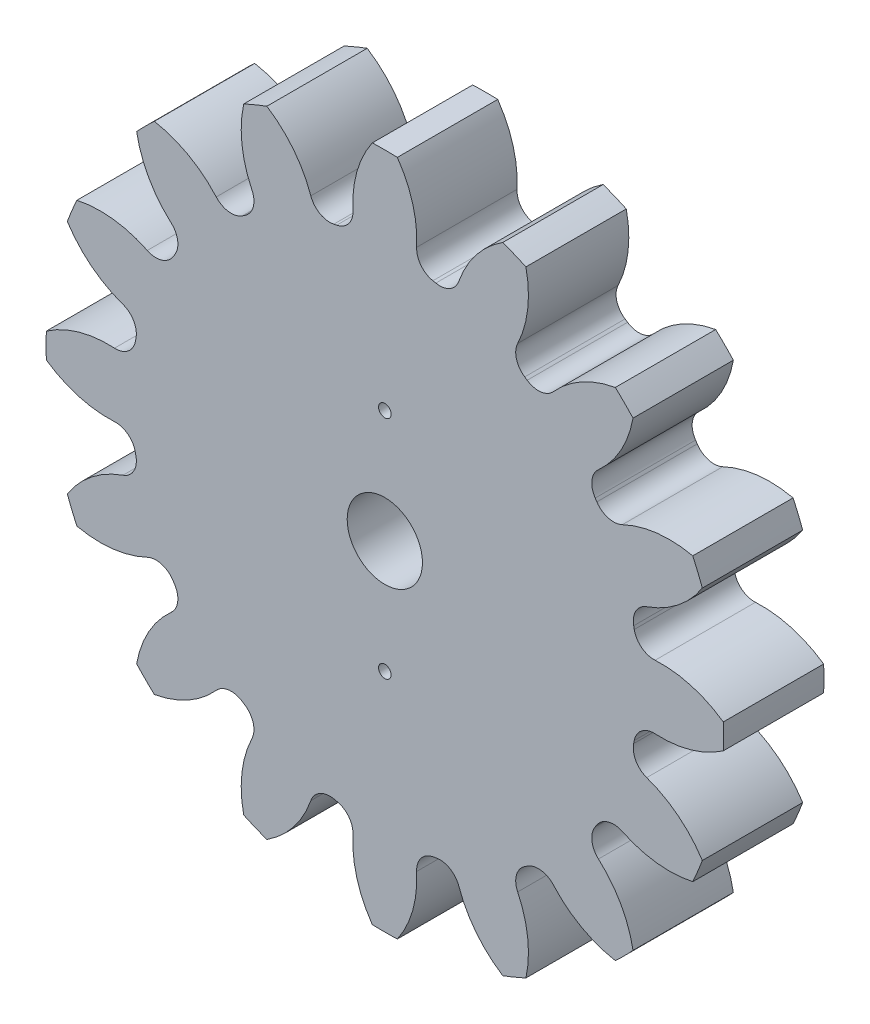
from build123d import *

# Parameters (mm, degrees)
BOSS_EXTRU_1_DEPTH                 = 8
CONG_1_R                           = 1.6
R_P_TITION_CIRCULAIRE4_COUNT       = 16
CONG_1_OF_R_P_TITION_CIRCULAIRE4_R = 1.6
ESQUISSE10_R                       = 3
ENL_V_MAT_EXTRU_4_DEPTH            = 41.3599312
ESQUISSE11_R                       = 12.5
ENL_V_MAT_EXTRU_6_DEPTH            = 2
ESQUISSE12_R                       = 0.5
ENL_V_MAT_EXTRU_7_DEPTH            = 6


with BuildPart() as part:
    # Esquisse3 → Boss.-Extru.1 (new body)
    with BuildSketch(Plane.XY):
        with BuildLine():
            Line((-5.329285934, 19.30054947), (-1.378706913, -0.560352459))
            Line((-1.378706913, -0.560352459), (2.571872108, 19.30054947))
            ThreePointArc((2.571872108, 19.30054947), (1.768197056, 19.443634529), (0.959408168, 19.554212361))
            ThreePointArc((0.959408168, 19.554212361), (1.01408656, 23.129067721), (-0.380383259, 26.421184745))
            ThreePointArc((-0.380383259, 26.421184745), (-1.378706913, 26.439647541), (-2.377030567, 26.421184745))
            ThreePointArc((-2.377030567, 26.421184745), (-3.771500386, 23.129067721), (-3.716821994, 19.554212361))
            ThreePointArc((-3.716821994, 19.554212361), (-4.525610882, 19.443634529), (-5.329285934, 19.30054947))
        make_face()
    boss_extru_1 = extrude(amount=BOSS_EXTRU_1_DEPTH)

    # Cong_1
    cong_1_edges = [part.edges().sort_by_distance(p)[0] for p in [
        (-3.716821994, 19.554212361, 4),
        (0.959408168, 19.554212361, 4),
    ]]
    fillet(cong_1_edges, radius=CONG_1_R)

    # R_p_tition circulaire4: Boss.-Extru.1 ×16 about axis
    r_p_tition_circulaire4_axis = Axis((-1.378706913, -0.560352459, 0), (0, 0, 1))
    for i in range(1, R_P_TITION_CIRCULAIRE4_COUNT):
        add(boss_extru_1.rotate(r_p_tition_circulaire4_axis, i * 360 / R_P_TITION_CIRCULAIRE4_COUNT))

    # Cong_1 of R_p_tition circulaire4
    cong_1_of_r_p_tition_circulaire4_edges = [part.edges().sort_by_distance(p)[0] for p in [
        (-11.236354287, 17.128324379, 4),
        (-6.916080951, 18.917840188, 4),
        (-17.255149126, 12.009495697, 4),
        (-13.948555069, 15.316089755, 4),
        (-20.856899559, 4.977021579, 4),
        (-19.067383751, 9.297294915, 4),
        (-21.493271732, -2.898467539, 4),
        (-21.493271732, 1.777762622, 4),
        (-19.067383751, -10.417999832, 4),
        (-20.856899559, -6.097726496, 4),
        (-13.948555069, -16.436794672, 4),
        (-17.255149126, -13.130200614, 4),
        (-6.916080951, -20.038545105, 4),
        (-11.236354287, -18.249029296, 4),
        (0.959408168, -20.674917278, 4),
        (-3.716821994, -20.674917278, 4),
        (8.47894046, -18.249029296, 4),
        (4.158667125, -20.038545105, 4),
        (14.4977353, -13.130200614, 4),
        (11.191141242, -16.436794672, 4),
        (18.099485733, -6.097726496, 4),
        (16.309969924, -10.417999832, 4),
        (18.735857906, 1.777762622, 4),
        (18.735857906, -2.898467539, 4),
        (16.309969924, 9.297294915, 4),
        (18.099485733, 4.977021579, 4),
        (11.191141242, 15.316089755, 4),
        (14.4977353, 12.009495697, 4),
        (4.158667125, 18.917840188, 4),
        (8.47894046, 17.128324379, 4),
    ]]
    fillet(cong_1_of_r_p_tition_circulaire4_edges, radius=CONG_1_OF_R_P_TITION_CIRCULAIRE4_R)

    # Esquisse10 → Enl_v. mat.-Extru.4 (cut, through all)
    with BuildSketch(Plane.XY):
        with Locations((-1.378706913, -0.560352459)):
            Circle(ESQUISSE10_R)
    extrude(amount=ENL_V_MAT_EXTRU_4_DEPTH, mode=Mode.SUBTRACT)

    # Esquisse11 → Enl_v. mat.-Extru.6 (cut)
    with BuildSketch(Plane(origin=(0, 0, 0), x_dir=(-1, 0, 0), z_dir=(0, 0, -1))):
        with Locations((1.378706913, -0.560352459)):
            Circle(ESQUISSE11_R)
    extrude(amount=-ENL_V_MAT_EXTRU_6_DEPTH, mode=Mode.SUBTRACT)

    # Esquisse12 → Enl_v. mat.-Extru.7 (cut)
    with BuildSketch(Plane(origin=(0, 0, 2), x_dir=(-1, 0, 0), z_dir=(0, 0, -1))):
        with Locations((1.378706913, -9.560352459)):
            Circle(ESQUISSE12_R)
        with Locations(Location((1.378706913, 8.439647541, 0), (0, 0, 180))):
            Circle(ESQUISSE12_R)
    extrude(amount=-ENL_V_MAT_EXTRU_7_DEPTH, mode=Mode.SUBTRACT)


solid = part.part
